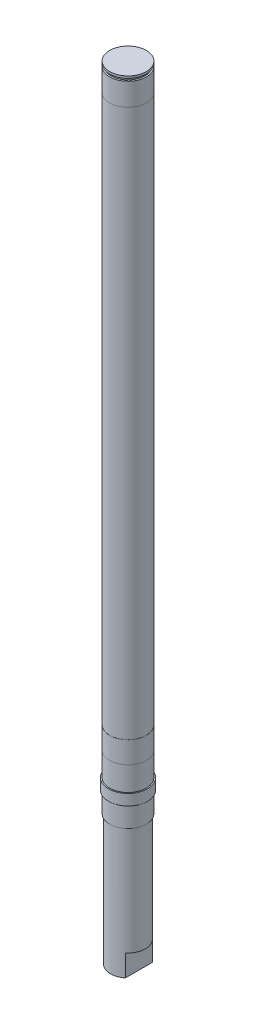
ISO-10303-21;
HEADER;
FILE_DESCRIPTION(('STEP AP214'),'2;1');
FILE_NAME('part.step','',(''),(''),'','','');
FILE_SCHEMA(('AUTOMOTIVE_DESIGN { 1 0 10303 214 1 1 1 1 }'));
ENDSEC;
DATA;
#1=APPLICATION_CONTEXT('core data for automotive mechanical design processes');
#2=APPLICATION_PROTOCOL_DEFINITION('international standard','automotive_design',2000,#1);
#3=PRODUCT_CONTEXT('',#1,'mechanical');
#4=PRODUCT('Part','Part','',(#3));
#5=PRODUCT_RELATED_PRODUCT_CATEGORY('part','',(#4));
#6=PRODUCT_DEFINITION_FORMATION('','',#4);
#7=PRODUCT_DEFINITION_CONTEXT('part definition',#1,'design');
#8=PRODUCT_DEFINITION('design','',#6,#7);
#9=PRODUCT_DEFINITION_SHAPE('','',#8);
#10=(LENGTH_UNIT() NAMED_UNIT(*) SI_UNIT(.MILLI.,.METRE.));
#11=(NAMED_UNIT(*) PLANE_ANGLE_UNIT() SI_UNIT($,.RADIAN.));
#12=(NAMED_UNIT(*) SI_UNIT($,.STERADIAN.) SOLID_ANGLE_UNIT());
#13=UNCERTAINTY_MEASURE_WITH_UNIT(LENGTH_MEASURE(1.E-05),#10,'distance_accuracy_value','');
#14=(GEOMETRIC_REPRESENTATION_CONTEXT(3) GLOBAL_UNCERTAINTY_ASSIGNED_CONTEXT((#13)) GLOBAL_UNIT_ASSIGNED_CONTEXT((#10,
#11,#12)) REPRESENTATION_CONTEXT('',''));
#15=CARTESIAN_POINT('',(0.,0.,0.));
#16=DIRECTION('',(0.,0.,1.));
#17=DIRECTION('',(1.,0.,0.));
#18=AXIS2_PLACEMENT_3D('',#15,#16,#17);
#19=CARTESIAN_POINT('',(0.,0.,0.));
#20=DIRECTION('',(0.,-1.,0.));
#21=DIRECTION('',(1.,0.,0.));
#22=AXIS2_PLACEMENT_3D('',#19,#20,#21);
#23=PLANE('',#22);
#24=CARTESIAN_POINT('',(0.,0.,0.));
#25=DIRECTION('',(0.,-1.,0.));
#26=DIRECTION('',(1.,0.,0.));
#27=AXIS2_PLACEMENT_3D('',#24,#25,#26);
#28=CIRCLE('',#27,8.00000000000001);
#29=CARTESIAN_POINT('',(5.,0.,6.24499799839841));
#30=VERTEX_POINT('',#29);
#31=CARTESIAN_POINT('',(-5.,0.,6.24499799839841));
#32=VERTEX_POINT('',#31);
#33=EDGE_CURVE('E90',#30,#32,#28,.T.);
#34=ORIENTED_EDGE('',*,*,#33,.T.);
#35=DIRECTION('',(0.,0.,-1.));
#36=VECTOR('',#35,1.);
#37=CARTESIAN_POINT('',(-5.,0.,-12.3053779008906));
#38=LINE('',#37,#36);
#39=CARTESIAN_POINT('',(-5.,0.,-6.24499799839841));
#40=VERTEX_POINT('',#39);
#41=EDGE_CURVE('E60',#32,#40,#38,.T.);
#42=ORIENTED_EDGE('',*,*,#41,.T.);
#43=CARTESIAN_POINT('',(5.,0.,-6.24499799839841));
#44=VERTEX_POINT('',#43);
#45=EDGE_CURVE('E92',#40,#44,#28,.T.);
#46=ORIENTED_EDGE('',*,*,#45,.T.);
#47=DIRECTION('',(0.,0.,1.));
#48=VECTOR('',#47,1.);
#49=CARTESIAN_POINT('',(5.,0.,-12.3053779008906));
#50=LINE('',#49,#48);
#51=EDGE_CURVE('E52',#44,#30,#50,.T.);
#52=ORIENTED_EDGE('',*,*,#51,.T.);
#53=EDGE_LOOP('',(#34,#42,#46,#52));
#54=FACE_BOUND('',#53,.T.);
#55=ADVANCED_FACE('F38',(#54),#23,.T.);
#56=CARTESIAN_POINT('',(0.,0.,0.));
#57=DIRECTION('',(0.,-1.,0.));
#58=DIRECTION('',(1.,0.,0.));
#59=AXIS2_PLACEMENT_3D('',#56,#57,#58);
#60=CYLINDRICAL_SURFACE('',#59,8.00000000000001);
#61=CARTESIAN_POINT('',(0.,60.,0.));
#62=DIRECTION('',(0.,-1.,0.));
#63=DIRECTION('',(1.,0.,0.));
#64=AXIS2_PLACEMENT_3D('',#61,#62,#63);
#65=CIRCLE('',#64,8.00000000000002);
#66=CARTESIAN_POINT('',(8.,60.,0.));
#67=VERTEX_POINT('',#66);
#68=EDGE_CURVE('E100',#67,#67,#65,.T.);
#69=ORIENTED_EDGE('',*,*,#68,.T.);
#70=EDGE_LOOP('',(#69));
#71=FACE_BOUND('',#70,.T.);
#72=ORIENTED_EDGE('',*,*,#45,.F.);
#73=DIRECTION('',(0.,-1.,0.));
#74=VECTOR('',#73,1.);
#75=CARTESIAN_POINT('',(-5.,0.,-6.24499799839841));
#76=LINE('',#75,#74);
#77=CARTESIAN_POINT('',(-5.,10.,-6.24499799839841));
#78=VERTEX_POINT('',#77);
#79=EDGE_CURVE('E12',#40,#78,#76,.F.);
#80=ORIENTED_EDGE('',*,*,#79,.T.);
#81=CARTESIAN_POINT('',(0.,10.,0.));
#82=DIRECTION('',(0.,-1.,0.));
#83=DIRECTION('',(0.,0.,-1.));
#84=AXIS2_PLACEMENT_3D('',#81,#82,#83);
#85=CIRCLE('',#84,8.00000000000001);
#86=CARTESIAN_POINT('',(-5.,10.,6.24499799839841));
#87=VERTEX_POINT('',#86);
#88=EDGE_CURVE('E45',#78,#87,#85,.F.);
#89=ORIENTED_EDGE('',*,*,#88,.T.);
#90=DIRECTION('',(0.,-1.,0.));
#91=VECTOR('',#90,1.);
#92=CARTESIAN_POINT('',(-5.,0.,6.24499799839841));
#93=LINE('',#92,#91);
#94=EDGE_CURVE('E84',#87,#32,#93,.T.);
#95=ORIENTED_EDGE('',*,*,#94,.T.);
#96=ORIENTED_EDGE('',*,*,#33,.F.);
#97=DIRECTION('',(0.,-1.,0.));
#98=VECTOR('',#97,1.);
#99=CARTESIAN_POINT('',(5.,0.,6.24499799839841));
#100=LINE('',#99,#98);
#101=CARTESIAN_POINT('',(5.,10.,6.24499799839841));
#102=VERTEX_POINT('',#101);
#103=EDGE_CURVE('E77',#30,#102,#100,.F.);
#104=ORIENTED_EDGE('',*,*,#103,.T.);
#105=CARTESIAN_POINT('',(5.,10.,-6.24499799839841));
#106=VERTEX_POINT('',#105);
#107=EDGE_CURVE('E85',#102,#106,#85,.F.);
#108=ORIENTED_EDGE('',*,*,#107,.T.);
#109=DIRECTION('',(0.,-1.,0.));
#110=VECTOR('',#109,1.);
#111=CARTESIAN_POINT('',(5.,0.,-6.24499799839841));
#112=LINE('',#111,#110);
#113=EDGE_CURVE('E97',#106,#44,#112,.T.);
#114=ORIENTED_EDGE('',*,*,#113,.T.);
#115=EDGE_LOOP('',(#72,#80,#89,#95,#96,#104,#108,#114));
#116=FACE_BOUND('',#115,.T.);
#117=ADVANCED_FACE('F95',(#71,#116),#60,.T.);
#118=CARTESIAN_POINT('',(8.45,60.,0.));
#119=DIRECTION('',(0.,-1.,0.));
#120=DIRECTION('',(1.,0.,0.));
#121=AXIS2_PLACEMENT_3D('',#118,#119,#120);
#122=PLANE('',#121);
#123=CARTESIAN_POINT('',(0.,60.,0.));
#124=DIRECTION('',(0.,-1.,0.));
#125=DIRECTION('',(1.,0.,0.));
#126=AXIS2_PLACEMENT_3D('',#123,#124,#125);
#127=CIRCLE('',#126,8.45000000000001);
#128=CARTESIAN_POINT('',(8.45,60.,0.));
#129=VERTEX_POINT('',#128);
#130=EDGE_CURVE('E157',#129,#129,#127,.T.);
#131=ORIENTED_EDGE('',*,*,#130,.T.);
#132=EDGE_LOOP('',(#131));
#133=FACE_BOUND('',#132,.T.);
#134=ORIENTED_EDGE('',*,*,#68,.F.);
#135=EDGE_LOOP('',(#134));
#136=FACE_BOUND('',#135,.T.);
#137=ADVANCED_FACE('F165',(#133,#136),#122,.T.);
#138=CARTESIAN_POINT('',(0.,0.,0.));
#139=DIRECTION('',(0.,-1.,0.));
#140=DIRECTION('',(1.,0.,0.));
#141=AXIS2_PLACEMENT_3D('',#138,#139,#140);
#142=CYLINDRICAL_SURFACE('',#141,8.45000000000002);
#143=CARTESIAN_POINT('',(0.,69.4,0.));
#144=DIRECTION('',(0.,-1.,0.));
#145=DIRECTION('',(1.,0.,0.));
#146=AXIS2_PLACEMENT_3D('',#143,#144,#145);
#147=CIRCLE('',#146,8.45000000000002);
#148=CARTESIAN_POINT('',(8.45,69.4,0.));
#149=VERTEX_POINT('',#148);
#150=EDGE_CURVE('E155',#149,#149,#147,.T.);
#151=ORIENTED_EDGE('',*,*,#150,.T.);
#152=EDGE_LOOP('',(#151));
#153=FACE_BOUND('',#152,.T.);
#154=ORIENTED_EDGE('',*,*,#130,.F.);
#155=EDGE_LOOP('',(#154));
#156=FACE_BOUND('',#155,.T.);
#157=ADVANCED_FACE('F167',(#153,#156),#142,.T.);
#158=CARTESIAN_POINT('',(8.45,69.4,0.));
#159=DIRECTION('',(0.,-1.,0.));
#160=DIRECTION('',(1.,0.,0.));
#161=AXIS2_PLACEMENT_3D('',#158,#159,#160);
#162=PLANE('',#161);
#163=CARTESIAN_POINT('',(0.,69.4,0.));
#164=DIRECTION('',(0.,-1.,0.));
#165=DIRECTION('',(1.,0.,0.));
#166=AXIS2_PLACEMENT_3D('',#163,#164,#165);
#167=CIRCLE('',#166,9.);
#168=CARTESIAN_POINT('',(8.99999999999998,69.4,0.));
#169=VERTEX_POINT('',#168);
#170=EDGE_CURVE('E152',#169,#169,#167,.T.);
#171=ORIENTED_EDGE('',*,*,#170,.T.);
#172=EDGE_LOOP('',(#171));
#173=FACE_BOUND('',#172,.T.);
#174=ORIENTED_EDGE('',*,*,#150,.F.);
#175=EDGE_LOOP('',(#174));
#176=FACE_BOUND('',#175,.T.);
#177=ADVANCED_FACE('F173',(#173,#176),#162,.T.);
#178=CARTESIAN_POINT('',(0.,0.,0.));
#179=DIRECTION('',(0.,-1.,0.));
#180=DIRECTION('',(1.,0.,0.));
#181=AXIS2_PLACEMENT_3D('',#178,#179,#180);
#182=CYLINDRICAL_SURFACE('',#181,9.);
#183=CARTESIAN_POINT('',(0.,74.4,0.));
#184=DIRECTION('',(0.,-1.,0.));
#185=DIRECTION('',(1.,0.,0.));
#186=AXIS2_PLACEMENT_3D('',#183,#184,#185);
#187=CIRCLE('',#186,9.);
#188=CARTESIAN_POINT('',(8.99999999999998,74.4,0.));
#189=VERTEX_POINT('',#188);
#190=EDGE_CURVE('E149',#189,#189,#187,.T.);
#191=ORIENTED_EDGE('',*,*,#190,.T.);
#192=EDGE_LOOP('',(#191));
#193=FACE_BOUND('',#192,.T.);
#194=ORIENTED_EDGE('',*,*,#170,.F.);
#195=EDGE_LOOP('',(#194));
#196=FACE_BOUND('',#195,.T.);
#197=ADVANCED_FACE('F274',(#193,#196),#182,.T.);
#198=CARTESIAN_POINT('',(8.45,74.4,0.));
#199=DIRECTION('',(0.,1.,0.));
#200=DIRECTION('',(-1.,0.,0.));
#201=AXIS2_PLACEMENT_3D('',#198,#199,#200);
#202=PLANE('',#201);
#203=CARTESIAN_POINT('',(0.,74.4,0.));
#204=DIRECTION('',(0.,-1.,0.));
#205=DIRECTION('',(1.,0.,0.));
#206=AXIS2_PLACEMENT_3D('',#203,#204,#205);
#207=CIRCLE('',#206,8.45000000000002);
#208=CARTESIAN_POINT('',(8.45,74.4,0.));
#209=VERTEX_POINT('',#208);
#210=EDGE_CURVE('E146',#209,#209,#207,.T.);
#211=ORIENTED_EDGE('',*,*,#210,.T.);
#212=EDGE_LOOP('',(#211));
#213=FACE_BOUND('',#212,.T.);
#214=ORIENTED_EDGE('',*,*,#190,.F.);
#215=EDGE_LOOP('',(#214));
#216=FACE_BOUND('',#215,.T.);
#217=ADVANCED_FACE('F270',(#213,#216),#202,.T.);
#218=CARTESIAN_POINT('',(0.,0.,0.));
#219=DIRECTION('',(0.,-1.,0.));
#220=DIRECTION('',(1.,0.,0.));
#221=AXIS2_PLACEMENT_3D('',#218,#219,#220);
#222=CYLINDRICAL_SURFACE('',#221,8.45000000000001);
#223=CARTESIAN_POINT('',(0.,85.5,0.));
#224=DIRECTION('',(0.,-1.,0.));
#225=DIRECTION('',(1.,0.,0.));
#226=AXIS2_PLACEMENT_3D('',#223,#224,#225);
#227=CIRCLE('',#226,8.45);
#228=CARTESIAN_POINT('',(8.44999999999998,85.5,0.));
#229=VERTEX_POINT('',#228);
#230=EDGE_CURVE('E143',#229,#229,#227,.T.);
#231=ORIENTED_EDGE('',*,*,#230,.T.);
#232=EDGE_LOOP('',(#231));
#233=FACE_BOUND('',#232,.T.);
#234=ORIENTED_EDGE('',*,*,#210,.F.);
#235=EDGE_LOOP('',(#234));
#236=FACE_BOUND('',#235,.T.);
#237=ADVANCED_FACE('F266',(#233,#236),#222,.T.);
#238=CARTESIAN_POINT('',(8.44999999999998,85.5,0.));
#239=DIRECTION('',(0.,-1.,0.));
#240=DIRECTION('',(1.,0.,0.));
#241=AXIS2_PLACEMENT_3D('',#238,#239,#240);
#242=PLANE('',#241);
#243=CARTESIAN_POINT('',(0.,85.5,0.));
#244=DIRECTION('',(0.,-1.,0.));
#245=DIRECTION('',(1.,0.,0.));
#246=AXIS2_PLACEMENT_3D('',#243,#244,#245);
#247=CIRCLE('',#246,8.5);
#248=CARTESIAN_POINT('',(8.49999999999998,85.5,0.));
#249=VERTEX_POINT('',#248);
#250=EDGE_CURVE('E140',#249,#249,#247,.T.);
#251=ORIENTED_EDGE('',*,*,#250,.T.);
#252=EDGE_LOOP('',(#251));
#253=FACE_BOUND('',#252,.T.);
#254=ORIENTED_EDGE('',*,*,#230,.F.);
#255=EDGE_LOOP('',(#254));
#256=FACE_BOUND('',#255,.T.);
#257=ADVANCED_FACE('F262',(#253,#256),#242,.T.);
#258=CARTESIAN_POINT('',(0.,0.,0.));
#259=DIRECTION('',(0.,-1.,0.));
#260=DIRECTION('',(1.,0.,0.));
#261=AXIS2_PLACEMENT_3D('',#258,#259,#260);
#262=CYLINDRICAL_SURFACE('',#261,8.5);
#263=CARTESIAN_POINT('',(0.,95.5,0.));
#264=DIRECTION('',(0.,-1.,0.));
#265=DIRECTION('',(1.,0.,0.));
#266=AXIS2_PLACEMENT_3D('',#263,#264,#265);
#267=CIRCLE('',#266,8.5);
#268=CARTESIAN_POINT('',(8.49999999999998,95.5,0.));
#269=VERTEX_POINT('',#268);
#270=EDGE_CURVE('E137',#269,#269,#267,.T.);
#271=ORIENTED_EDGE('',*,*,#270,.T.);
#272=EDGE_LOOP('',(#271));
#273=FACE_BOUND('',#272,.T.);
#274=ORIENTED_EDGE('',*,*,#250,.F.);
#275=EDGE_LOOP('',(#274));
#276=FACE_BOUND('',#275,.T.);
#277=ADVANCED_FACE('F258',(#273,#276),#262,.T.);
#278=CARTESIAN_POINT('',(8.49999999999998,95.5,0.));
#279=DIRECTION('',(0.,1.,0.));
#280=DIRECTION('',(-1.,0.,0.));
#281=AXIS2_PLACEMENT_3D('',#278,#279,#280);
#282=PLANE('',#281);
#283=CARTESIAN_POINT('',(0.,95.5,0.));
#284=DIRECTION('',(0.,-1.,0.));
#285=DIRECTION('',(1.,0.,0.));
#286=AXIS2_PLACEMENT_3D('',#283,#284,#285);
#287=CIRCLE('',#286,8.45);
#288=CARTESIAN_POINT('',(8.44999999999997,95.5,0.));
#289=VERTEX_POINT('',#288);
#290=EDGE_CURVE('E134',#289,#289,#287,.T.);
#291=ORIENTED_EDGE('',*,*,#290,.T.);
#292=EDGE_LOOP('',(#291));
#293=FACE_BOUND('',#292,.T.);
#294=ORIENTED_EDGE('',*,*,#270,.F.);
#295=EDGE_LOOP('',(#294));
#296=FACE_BOUND('',#295,.T.);
#297=ADVANCED_FACE('F254',(#293,#296),#282,.T.);
#298=CARTESIAN_POINT('',(0.,0.,0.));
#299=DIRECTION('',(0.,-1.,0.));
#300=DIRECTION('',(1.,0.,0.));
#301=AXIS2_PLACEMENT_3D('',#298,#299,#300);
#302=CYLINDRICAL_SURFACE('',#301,8.45000000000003);
#303=CARTESIAN_POINT('',(0.,348.,0.));
#304=DIRECTION('',(0.,-1.,0.));
#305=DIRECTION('',(1.,0.,0.));
#306=AXIS2_PLACEMENT_3D('',#303,#304,#305);
#307=CIRCLE('',#306,8.45000000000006);
#308=CARTESIAN_POINT('',(8.44999999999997,348.,0.));
#309=VERTEX_POINT('',#308);
#310=EDGE_CURVE('E131',#309,#309,#307,.T.);
#311=ORIENTED_EDGE('',*,*,#310,.T.);
#312=EDGE_LOOP('',(#311));
#313=FACE_BOUND('',#312,.T.);
#314=ORIENTED_EDGE('',*,*,#290,.F.);
#315=EDGE_LOOP('',(#314));
#316=FACE_BOUND('',#315,.T.);
#317=ADVANCED_FACE('F250',(#313,#316),#302,.T.);
#318=CARTESIAN_POINT('',(8.44999999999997,348.,0.));
#319=DIRECTION('',(0.,-1.,0.));
#320=DIRECTION('',(1.,0.,0.));
#321=AXIS2_PLACEMENT_3D('',#318,#319,#320);
#322=PLANE('',#321);
#323=CARTESIAN_POINT('',(0.,348.,0.));
#324=DIRECTION('',(0.,-1.,0.));
#325=DIRECTION('',(1.,0.,0.));
#326=AXIS2_PLACEMENT_3D('',#323,#324,#325);
#327=CIRCLE('',#326,8.5);
#328=CARTESIAN_POINT('',(8.49999999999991,348.,0.));
#329=VERTEX_POINT('',#328);
#330=EDGE_CURVE('E128',#329,#329,#327,.T.);
#331=ORIENTED_EDGE('',*,*,#330,.T.);
#332=EDGE_LOOP('',(#331));
#333=FACE_BOUND('',#332,.T.);
#334=ORIENTED_EDGE('',*,*,#310,.F.);
#335=EDGE_LOOP('',(#334));
#336=FACE_BOUND('',#335,.T.);
#337=ADVANCED_FACE('F246',(#333,#336),#322,.T.);
#338=CARTESIAN_POINT('',(0.,0.,0.));
#339=DIRECTION('',(0.,-1.,0.));
#340=DIRECTION('',(1.,0.,0.));
#341=AXIS2_PLACEMENT_3D('',#338,#339,#340);
#342=CYLINDRICAL_SURFACE('',#341,8.5);
#343=CARTESIAN_POINT('',(0.,358.4,0.));
#344=DIRECTION('',(0.,-1.,0.));
#345=DIRECTION('',(1.,0.,0.));
#346=AXIS2_PLACEMENT_3D('',#343,#344,#345);
#347=CIRCLE('',#346,8.5);
#348=CARTESIAN_POINT('',(8.49999999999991,358.4,0.));
#349=VERTEX_POINT('',#348);
#350=EDGE_CURVE('E125',#349,#349,#347,.T.);
#351=ORIENTED_EDGE('',*,*,#350,.T.);
#352=EDGE_LOOP('',(#351));
#353=FACE_BOUND('',#352,.T.);
#354=ORIENTED_EDGE('',*,*,#330,.F.);
#355=EDGE_LOOP('',(#354));
#356=FACE_BOUND('',#355,.T.);
#357=ADVANCED_FACE('F242',(#353,#356),#342,.T.);
#358=CARTESIAN_POINT('',(8.49999999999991,358.4,0.));
#359=DIRECTION('',(0.,1.,0.));
#360=DIRECTION('',(-1.,0.,0.));
#361=AXIS2_PLACEMENT_3D('',#358,#359,#360);
#362=PLANE('',#361);
#363=CARTESIAN_POINT('',(0.,358.4,0.));
#364=DIRECTION('',(0.,-1.,0.));
#365=DIRECTION('',(1.,0.,0.));
#366=AXIS2_PLACEMENT_3D('',#363,#364,#365);
#367=CIRCLE('',#366,7.75);
#368=CARTESIAN_POINT('',(7.74999999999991,358.4,0.));
#369=VERTEX_POINT('',#368);
#370=EDGE_CURVE('E122',#369,#369,#367,.T.);
#371=ORIENTED_EDGE('',*,*,#370,.T.);
#372=EDGE_LOOP('',(#371));
#373=FACE_BOUND('',#372,.T.);
#374=ORIENTED_EDGE('',*,*,#350,.F.);
#375=EDGE_LOOP('',(#374));
#376=FACE_BOUND('',#375,.T.);
#377=ADVANCED_FACE('F238',(#373,#376),#362,.T.);
#378=CARTESIAN_POINT('',(0.,0.,0.));
#379=DIRECTION('',(0.,-1.,0.));
#380=DIRECTION('',(1.,0.,0.));
#381=AXIS2_PLACEMENT_3D('',#378,#379,#380);
#382=CYLINDRICAL_SURFACE('',#381,7.75);
#383=CARTESIAN_POINT('',(0.,359.5,0.));
#384=DIRECTION('',(0.,-1.,0.));
#385=DIRECTION('',(1.,0.,0.));
#386=AXIS2_PLACEMENT_3D('',#383,#384,#385);
#387=CIRCLE('',#386,7.75);
#388=CARTESIAN_POINT('',(7.74999999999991,359.5,0.));
#389=VERTEX_POINT('',#388);
#390=EDGE_CURVE('E119',#389,#389,#387,.T.);
#391=ORIENTED_EDGE('',*,*,#390,.T.);
#392=EDGE_LOOP('',(#391));
#393=FACE_BOUND('',#392,.T.);
#394=ORIENTED_EDGE('',*,*,#370,.F.);
#395=EDGE_LOOP('',(#394));
#396=FACE_BOUND('',#395,.T.);
#397=ADVANCED_FACE('F234',(#393,#396),#382,.T.);
#398=CARTESIAN_POINT('',(8.44999999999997,359.5,0.));
#399=DIRECTION('',(0.,-1.,0.));
#400=DIRECTION('',(1.,0.,0.));
#401=AXIS2_PLACEMENT_3D('',#398,#399,#400);
#402=PLANE('',#401);
#403=CARTESIAN_POINT('',(0.,359.5,0.));
#404=DIRECTION('',(0.,-1.,0.));
#405=DIRECTION('',(1.,0.,0.));
#406=AXIS2_PLACEMENT_3D('',#403,#404,#405);
#407=CIRCLE('',#406,8.45000000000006);
#408=CARTESIAN_POINT('',(8.44999999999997,359.5,0.));
#409=VERTEX_POINT('',#408);
#410=EDGE_CURVE('E116',#409,#409,#407,.T.);
#411=ORIENTED_EDGE('',*,*,#410,.T.);
#412=EDGE_LOOP('',(#411));
#413=FACE_BOUND('',#412,.T.);
#414=ORIENTED_EDGE('',*,*,#390,.F.);
#415=EDGE_LOOP('',(#414));
#416=FACE_BOUND('',#415,.T.);
#417=ADVANCED_FACE('F230',(#413,#416),#402,.T.);
#418=CARTESIAN_POINT('',(0.,0.,0.));
#419=DIRECTION('',(0.,-1.,0.));
#420=DIRECTION('',(1.,0.,0.));
#421=AXIS2_PLACEMENT_3D('',#418,#419,#420);
#422=CYLINDRICAL_SURFACE('',#421,8.45000000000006);
#423=CARTESIAN_POINT('',(0.,360.5,0.));
#424=DIRECTION('',(0.,-1.,0.));
#425=DIRECTION('',(1.,0.,0.));
#426=AXIS2_PLACEMENT_3D('',#423,#424,#425);
#427=CIRCLE('',#426,8.45000000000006);
#428=CARTESIAN_POINT('',(8.44999999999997,360.5,0.));
#429=VERTEX_POINT('',#428);
#430=EDGE_CURVE('E110',#429,#429,#427,.T.);
#431=ORIENTED_EDGE('',*,*,#430,.T.);
#432=EDGE_LOOP('',(#431));
#433=FACE_BOUND('',#432,.T.);
#434=ORIENTED_EDGE('',*,*,#410,.F.);
#435=EDGE_LOOP('',(#434));
#436=FACE_BOUND('',#435,.T.);
#437=ADVANCED_FACE('F226',(#433,#436),#422,.T.);
#438=CARTESIAN_POINT('',(8.44999999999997,360.5,0.));
#439=DIRECTION('',(0.,1.,0.));
#440=DIRECTION('',(-1.,0.,0.));
#441=AXIS2_PLACEMENT_3D('',#438,#439,#440);
#442=PLANE('',#441);
#443=ORIENTED_EDGE('',*,*,#430,.F.);
#444=EDGE_LOOP('',(#443));
#445=FACE_BOUND('',#444,.T.);
#446=ADVANCED_FACE('F195',(#445),#442,.T.);
#447=CARTESIAN_POINT('',(5.,10.,-12.3053779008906));
#448=DIRECTION('',(1.,0.,0.));
#449=DIRECTION('',(0.,0.,-1.));
#450=AXIS2_PLACEMENT_3D('',#447,#448,#449);
#451=PLANE('',#450);
#452=ORIENTED_EDGE('',*,*,#51,.F.);
#453=ORIENTED_EDGE('',*,*,#113,.F.);
#454=DIRECTION('',(0.,0.,1.));
#455=VECTOR('',#454,1.);
#456=CARTESIAN_POINT('',(5.,10.,-12.3053779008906));
#457=LINE('',#456,#455);
#458=EDGE_CURVE('E80',#106,#102,#457,.T.);
#459=ORIENTED_EDGE('',*,*,#458,.T.);
#460=ORIENTED_EDGE('',*,*,#103,.F.);
#461=EDGE_LOOP('',(#452,#453,#459,#460));
#462=FACE_BOUND('',#461,.T.);
#463=ADVANCED_FACE('F78',(#462),#451,.T.);
#464=CARTESIAN_POINT('',(0.,10.,0.));
#465=DIRECTION('',(0.,-1.,0.));
#466=DIRECTION('',(0.,0.,-1.));
#467=AXIS2_PLACEMENT_3D('',#464,#465,#466);
#468=PLANE('',#467);
#469=ORIENTED_EDGE('',*,*,#458,.F.);
#470=ORIENTED_EDGE('',*,*,#107,.F.);
#471=EDGE_LOOP('',(#469,#470));
#472=FACE_BOUND('',#471,.T.);
#473=ADVANCED_FACE('F194',(#472),#468,.T.);
#474=DIRECTION('',(0.,0.,-1.));
#475=VECTOR('',#474,1.);
#476=CARTESIAN_POINT('',(-5.,10.,-12.3053779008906));
#477=LINE('',#476,#475);
#478=EDGE_CURVE('E93',#87,#78,#477,.T.);
#479=ORIENTED_EDGE('',*,*,#478,.F.);
#480=ORIENTED_EDGE('',*,*,#88,.F.);
#481=EDGE_LOOP('',(#479,#480));
#482=FACE_BOUND('',#481,.T.);
#483=ADVANCED_FACE('F107',(#482),#468,.T.);
#484=CARTESIAN_POINT('',(-5.,10.,-12.3053779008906));
#485=DIRECTION('',(-1.,0.,0.));
#486=DIRECTION('',(0.,0.,1.));
#487=AXIS2_PLACEMENT_3D('',#484,#485,#486);
#488=PLANE('',#487);
#489=ORIENTED_EDGE('',*,*,#41,.F.);
#490=ORIENTED_EDGE('',*,*,#94,.F.);
#491=ORIENTED_EDGE('',*,*,#478,.T.);
#492=ORIENTED_EDGE('',*,*,#79,.F.);
#493=EDGE_LOOP('',(#489,#490,#491,#492));
#494=FACE_BOUND('',#493,.T.);
#495=ADVANCED_FACE('F108',(#494),#488,.T.);
#496=CLOSED_SHELL('',(#55,#117,#137,#157,#177,#197,#217,#237,#257,#277,#297,#317,#337,#357,#377,
#397,#417,#437,#446,#463,#473,#483,#495));
#497=MANIFOLD_SOLID_BREP('B2',#496);
#498=ADVANCED_BREP_SHAPE_REPRESENTATION('',(#18,#497),#14);
#499=SHAPE_DEFINITION_REPRESENTATION(#9,#498);
ENDSEC;
END-ISO-10303-21;
